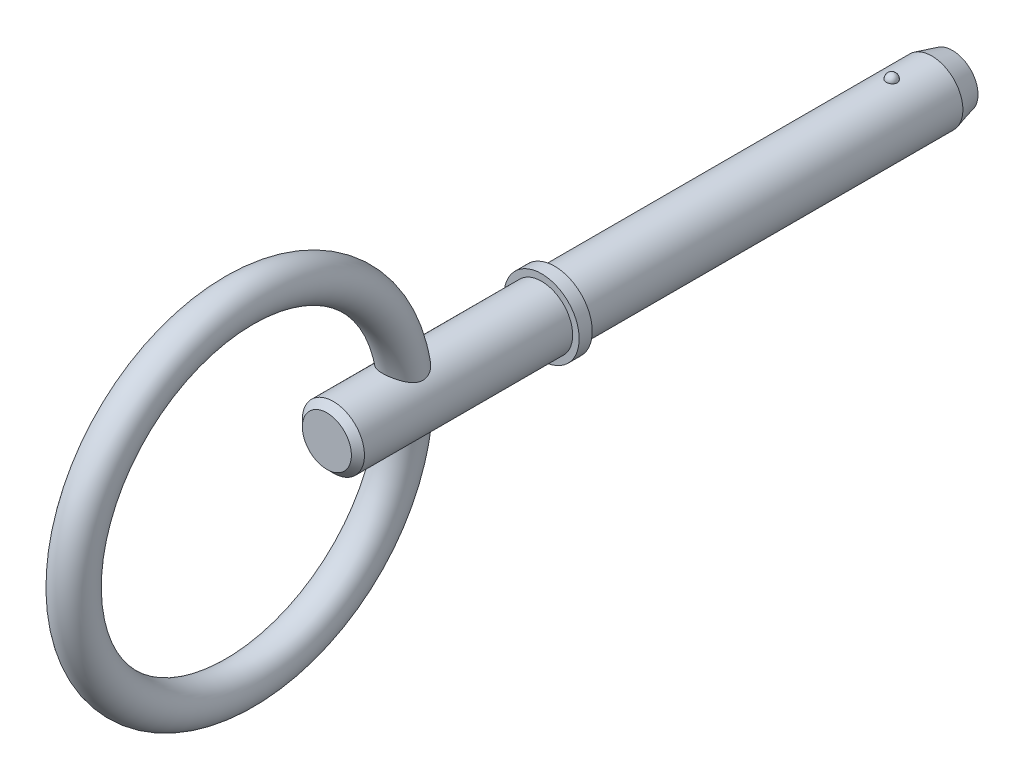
from build123d import *

# Parameters (mm, degrees)
SKETCH2_R           = 2.38
BOSS_EXTRUDE1_DEPTH = 25.4
BOSS_EXTRUDE2_START = 5.08
SKETCH3_R           = 2.38
BOSS_EXTRUDE2_DEPTH = 5.08
CHAMFER1_SIZE       = 1.586
CHAMFER1_SIZE2      = 0.424967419
SKETCH20_W          = 1
SKETCH20_H          = 2.88
SKETCH21_R          = 2.38
BOSS_EXTRUDE3_DEPTH = 17.45
CHAMFER2_SIZE       = 0.5
SKETCH24_R          = 1.5


with BuildPart() as part:
    # Sketch2 → Boss-Extrude1 (new body)
    with BuildSketch(Plane.XY):
        Circle(SKETCH2_R)
    extrude(amount=BOSS_EXTRUDE1_DEPTH)

    # Sketch3 → Boss-Extrude2 (add)
    with BuildSketch(Plane(origin=(0, 0, 0), x_dir=(-1, 0, 0), z_dir=(0, 0, -1)).offset(BOSS_EXTRUDE2_START)):
        Circle(SKETCH3_R)
    extrude(amount=-BOSS_EXTRUDE2_DEPTH)

    # Chamfer1
    chamfer1_edges = [part.edges().sort_by_distance(p)[0] for p in [
        (2.38, 0, -5.08),
    ]]
    chamfer1_side = [part.faces().sort_by_distance(p)[0] for p in [
        (2.38, 0, -2.54),
    ]]
    chamfer(chamfer1_edges, length=CHAMFER1_SIZE, length2=CHAMFER1_SIZE2, reference=chamfer1_side[0])

    # Sketch18 → Revolve1 (revolve)
    with BuildSketch(Plane(origin=(0, 0, 0), x_dir=(0, 0, -1), z_dir=(1, 0, 0))):
        with BuildLine():
            Line((0.42, 2.8), (0.42, 1.96))
            ThreePointArc((0.42, 1.96), (0, 2.38), (0.42, 2.8))
        make_face()
    revolve(axis=Axis((0, 2.8, -0.42), (0, -1, 0)))

    # Sketch20 → Revolve2 (revolve)
    with BuildSketch(Plane(origin=(0, 0, 0), x_dir=(0, 0, -1), z_dir=(1, 0, 0)), mode=Mode.PRIVATE) as revolve2_sk:
        with Locations((-25.9, 1.44)):
            Rectangle(SKETCH20_W, SKETCH20_H)
    revolve(revolve2_sk.sketch.rotate(Axis((0, 0, 33.728787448), (0, 0, 1)), 90), axis=Axis((0, 0, 33.728787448), (0, 0, 1)))

    # Sketch21 → Boss-Extrude3 (add)
    with BuildSketch(Plane(origin=(0, 0, 25.4), x_dir=(-1, 0, 0), z_dir=(0, 0, -1))):
        Circle(SKETCH21_R)
    extrude(amount=-BOSS_EXTRUDE3_DEPTH)

    # Chamfer2
    chamfer2_edges = [part.edges().sort_by_distance(p)[0] for p in [
        (2.38, 0, 42.85),
    ]]
    chamfer(chamfer2_edges, length=CHAMFER2_SIZE)

    # Sweep1: sweep along a path in Sketch23
    with BuildLine(Plane(origin=(0, 0, 0), x_dir=(0, 0, -1), z_dir=(1, 0, 0))) as sweep1_path:
        CenterArc((-49.55, 0), 12.7, 0, 360)
    # Sketch24 → Sweep1 (sweep)
    with BuildSketch(Plane(origin=(0, 0, 0), x_dir=(1, 0, 0), z_dir=(0, 1, 0))):
        with Locations((0, -36.85)):
            Circle(SKETCH24_R)
    sweep(path=sweep1_path.line)


solid = part.part
